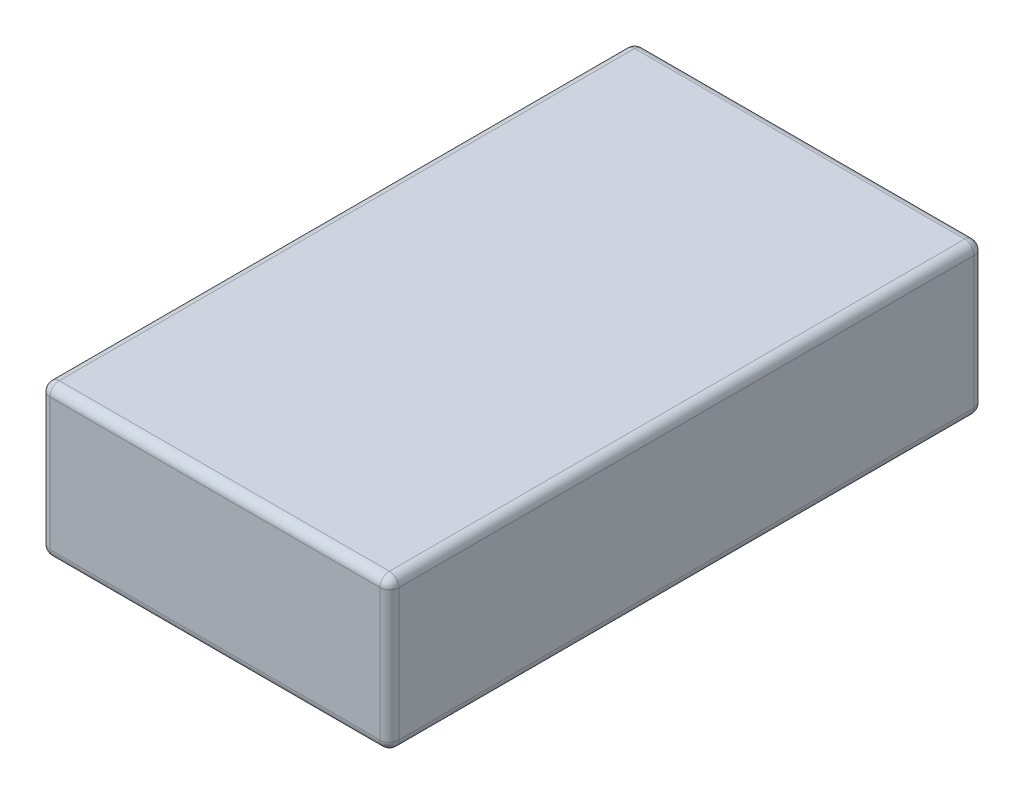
ISO-10303-21;
HEADER;
FILE_DESCRIPTION(('STEP AP214'),'2;1');
FILE_NAME('part.step','',(''),(''),'','','');
FILE_SCHEMA(('AUTOMOTIVE_DESIGN { 1 0 10303 214 1 1 1 1 }'));
ENDSEC;
DATA;
#1=APPLICATION_CONTEXT('core data for automotive mechanical design processes');
#2=APPLICATION_PROTOCOL_DEFINITION('international standard','automotive_design',2000,#1);
#3=PRODUCT_CONTEXT('',#1,'mechanical');
#4=PRODUCT('Part','Part','',(#3));
#5=PRODUCT_RELATED_PRODUCT_CATEGORY('part','',(#4));
#6=PRODUCT_DEFINITION_FORMATION('','',#4);
#7=PRODUCT_DEFINITION_CONTEXT('part definition',#1,'design');
#8=PRODUCT_DEFINITION('design','',#6,#7);
#9=PRODUCT_DEFINITION_SHAPE('','',#8);
#10=(LENGTH_UNIT() NAMED_UNIT(*) SI_UNIT(.MILLI.,.METRE.));
#11=(NAMED_UNIT(*) PLANE_ANGLE_UNIT() SI_UNIT($,.RADIAN.));
#12=(NAMED_UNIT(*) SI_UNIT($,.STERADIAN.) SOLID_ANGLE_UNIT());
#13=UNCERTAINTY_MEASURE_WITH_UNIT(LENGTH_MEASURE(1.E-05),#10,'distance_accuracy_value','');
#14=(GEOMETRIC_REPRESENTATION_CONTEXT(3) GLOBAL_UNCERTAINTY_ASSIGNED_CONTEXT((#13)) GLOBAL_UNIT_ASSIGNED_CONTEXT((#10,
#11,#12)) REPRESENTATION_CONTEXT('',''));
#15=CARTESIAN_POINT('',(0.,0.,0.));
#16=DIRECTION('',(0.,0.,1.));
#17=DIRECTION('',(1.,0.,0.));
#18=AXIS2_PLACEMENT_3D('',#15,#16,#17);
#19=CARTESIAN_POINT('',(20.,2.5,-7.));
#20=DIRECTION('',(0.,-1.,0.));
#21=DIRECTION('',(0.,0.,-1.));
#22=AXIS2_PLACEMENT_3D('',#19,#20,#21);
#23=PLANE('',#22);
#24=DIRECTION('',(0.,0.,-1.));
#25=VECTOR('',#24,1.);
#26=CARTESIAN_POINT('',(20.,2.5,-3.));
#27=LINE('',#26,#25);
#28=CARTESIAN_POINT('',(20.,2.5,-3.));
#29=VERTEX_POINT('',#28);
#30=CARTESIAN_POINT('',(20.,2.5,-7.));
#31=VERTEX_POINT('',#30);
#32=EDGE_CURVE('E224',#29,#31,#27,.T.);
#33=ORIENTED_EDGE('',*,*,#32,.T.);
#34=DIRECTION('',(1.,0.,0.));
#35=VECTOR('',#34,1.);
#36=CARTESIAN_POINT('',(20.,2.5,-7.));
#37=LINE('',#36,#35);
#38=CARTESIAN_POINT('',(28.,2.5,-7.));
#39=VERTEX_POINT('',#38);
#40=EDGE_CURVE('E227',#31,#39,#37,.T.);
#41=ORIENTED_EDGE('',*,*,#40,.T.);
#42=DIRECTION('',(0.,0.,1.));
#43=VECTOR('',#42,1.);
#44=CARTESIAN_POINT('',(28.,2.5,-3.));
#45=LINE('',#44,#43);
#46=CARTESIAN_POINT('',(28.,2.5,-3.));
#47=VERTEX_POINT('',#46);
#48=EDGE_CURVE('E230',#39,#47,#45,.T.);
#49=ORIENTED_EDGE('',*,*,#48,.T.);
#50=DIRECTION('',(-1.,0.,0.));
#51=VECTOR('',#50,1.);
#52=CARTESIAN_POINT('',(20.,2.5,-3.));
#53=LINE('',#52,#51);
#54=EDGE_CURVE('E233',#47,#29,#53,.T.);
#55=ORIENTED_EDGE('',*,*,#54,.T.);
#56=EDGE_LOOP('',(#33,#41,#49,#55));
#57=FACE_BOUND('',#56,.T.);
#58=DIRECTION('',(1.,0.,0.));
#59=VECTOR('',#58,1.);
#60=CARTESIAN_POINT('',(20.2,2.5,-6.5));
#61=LINE('',#60,#59);
#62=CARTESIAN_POINT('',(20.2,2.5,-6.5));
#63=VERTEX_POINT('',#62);
#64=CARTESIAN_POINT('',(23.2,2.5,-6.5));
#65=VERTEX_POINT('',#64);
#66=EDGE_CURVE('E175',#63,#65,#61,.T.);
#67=ORIENTED_EDGE('',*,*,#66,.F.);
#68=DIRECTION('',(0.,0.,-1.));
#69=VECTOR('',#68,1.);
#70=CARTESIAN_POINT('',(20.2,2.5,-3.5));
#71=LINE('',#70,#69);
#72=CARTESIAN_POINT('',(20.2,2.5,-3.5));
#73=VERTEX_POINT('',#72);
#74=EDGE_CURVE('E186',#73,#63,#71,.T.);
#75=ORIENTED_EDGE('',*,*,#74,.F.);
#76=DIRECTION('',(-1.,0.,0.));
#77=VECTOR('',#76,1.);
#78=CARTESIAN_POINT('',(20.2,2.5,-3.5));
#79=LINE('',#78,#77);
#80=CARTESIAN_POINT('',(23.2,2.5,-3.5));
#81=VERTEX_POINT('',#80);
#82=EDGE_CURVE('E198',#81,#73,#79,.T.);
#83=ORIENTED_EDGE('',*,*,#82,.F.);
#84=DIRECTION('',(0.,0.,1.));
#85=VECTOR('',#84,1.);
#86=CARTESIAN_POINT('',(23.2,2.5,-3.5));
#87=LINE('',#86,#85);
#88=EDGE_CURVE('E196',#65,#81,#87,.T.);
#89=ORIENTED_EDGE('',*,*,#88,.F.);
#90=EDGE_LOOP('',(#67,#75,#83,#89));
#91=FACE_BOUND('',#90,.T.);
#92=ADVANCED_FACE('F33',(#57,#91),#23,.T.);
#93=CARTESIAN_POINT('',(0.,16.,0.));
#94=DIRECTION('',(1.,0.,0.));
#95=DIRECTION('',(0.,0.,-1.));
#96=AXIS2_PLACEMENT_3D('',#93,#94,#95);
#97=PLANE('',#96);
#98=DIRECTION('',(0.,-1.,0.));
#99=VECTOR('',#98,1.);
#100=CARTESIAN_POINT('',(0.,16.,-62.));
#101=LINE('',#100,#99);
#102=CARTESIAN_POINT('',(0.,15.,-62.));
#103=VERTEX_POINT('',#102);
#104=CARTESIAN_POINT('',(0.,1.,-62.));
#105=VERTEX_POINT('',#104);
#106=EDGE_CURVE('E249',#103,#105,#101,.T.);
#107=ORIENTED_EDGE('',*,*,#106,.T.);
#108=DIRECTION('',(0.,0.,1.));
#109=VECTOR('',#108,1.);
#110=CARTESIAN_POINT('',(0.,1.,0.));
#111=LINE('',#110,#109);
#112=CARTESIAN_POINT('',(0.,1.,-1.));
#113=VERTEX_POINT('',#112);
#114=EDGE_CURVE('E251',#105,#113,#111,.T.);
#115=ORIENTED_EDGE('',*,*,#114,.T.);
#116=DIRECTION('',(0.,-1.,0.));
#117=VECTOR('',#116,1.);
#118=CARTESIAN_POINT('',(0.,16.,-1.));
#119=LINE('',#118,#117);
#120=CARTESIAN_POINT('',(0.,15.,-1.));
#121=VERTEX_POINT('',#120);
#122=EDGE_CURVE('E247',#113,#121,#119,.F.);
#123=ORIENTED_EDGE('',*,*,#122,.T.);
#124=DIRECTION('',(0.,0.,1.));
#125=VECTOR('',#124,1.);
#126=CARTESIAN_POINT('',(0.,15.,0.));
#127=LINE('',#126,#125);
#128=EDGE_CURVE('E239',#121,#103,#127,.F.);
#129=ORIENTED_EDGE('',*,*,#128,.T.);
#130=EDGE_LOOP('',(#107,#115,#123,#129));
#131=FACE_BOUND('',#130,.T.);
#132=ADVANCED_FACE('F35',(#131),#97,.F.);
#133=CARTESIAN_POINT('',(0.,16.,0.));
#134=DIRECTION('',(0.,0.,-1.));
#135=DIRECTION('',(-1.,0.,0.));
#136=AXIS2_PLACEMENT_3D('',#133,#134,#135);
#137=PLANE('',#136);
#138=DIRECTION('',(1.,0.,0.));
#139=VECTOR('',#138,1.);
#140=CARTESIAN_POINT('',(0.,15.,0.));
#141=LINE('',#140,#139);
#142=CARTESIAN_POINT('',(36.,15.,0.));
#143=VERTEX_POINT('',#142);
#144=CARTESIAN_POINT('',(1.,15.,0.));
#145=VERTEX_POINT('',#144);
#146=EDGE_CURVE('E272',#143,#145,#141,.F.);
#147=ORIENTED_EDGE('',*,*,#146,.T.);
#148=DIRECTION('',(0.,-1.,0.));
#149=VECTOR('',#148,1.);
#150=CARTESIAN_POINT('',(1.,16.,0.));
#151=LINE('',#150,#149);
#152=CARTESIAN_POINT('',(1.,1.,0.));
#153=VERTEX_POINT('',#152);
#154=EDGE_CURVE('E278',#145,#153,#151,.T.);
#155=ORIENTED_EDGE('',*,*,#154,.T.);
#156=DIRECTION('',(1.,0.,0.));
#157=VECTOR('',#156,1.);
#158=CARTESIAN_POINT('',(37.,1.,0.));
#159=LINE('',#158,#157);
#160=CARTESIAN_POINT('',(36.,1.,0.));
#161=VERTEX_POINT('',#160);
#162=EDGE_CURVE('E276',#153,#161,#159,.T.);
#163=ORIENTED_EDGE('',*,*,#162,.T.);
#164=DIRECTION('',(0.,-1.,0.));
#165=VECTOR('',#164,1.);
#166=CARTESIAN_POINT('',(36.,16.,0.));
#167=LINE('',#166,#165);
#168=EDGE_CURVE('E274',#161,#143,#167,.F.);
#169=ORIENTED_EDGE('',*,*,#168,.T.);
#170=EDGE_LOOP('',(#147,#155,#163,#169));
#171=FACE_BOUND('',#170,.T.);
#172=ADVANCED_FACE('F444',(#171),#137,.F.);
#173=CARTESIAN_POINT('',(37.,16.,0.));
#174=DIRECTION('',(-1.,0.,0.));
#175=DIRECTION('',(0.,0.,1.));
#176=AXIS2_PLACEMENT_3D('',#173,#174,#175);
#177=PLANE('',#176);
#178=DIRECTION('',(0.,0.,-1.));
#179=VECTOR('',#178,1.);
#180=CARTESIAN_POINT('',(37.,15.,0.));
#181=LINE('',#180,#179);
#182=CARTESIAN_POINT('',(37.,15.,-62.));
#183=VERTEX_POINT('',#182);
#184=CARTESIAN_POINT('',(37.,15.,-1.));
#185=VERTEX_POINT('',#184);
#186=EDGE_CURVE('E281',#183,#185,#181,.F.);
#187=ORIENTED_EDGE('',*,*,#186,.T.);
#188=DIRECTION('',(0.,-1.,0.));
#189=VECTOR('',#188,1.);
#190=CARTESIAN_POINT('',(37.,16.,-1.));
#191=LINE('',#190,#189);
#192=CARTESIAN_POINT('',(37.,1.,-1.));
#193=VERTEX_POINT('',#192);
#194=EDGE_CURVE('E287',#185,#193,#191,.T.);
#195=ORIENTED_EDGE('',*,*,#194,.T.);
#196=DIRECTION('',(0.,0.,-1.));
#197=VECTOR('',#196,1.);
#198=CARTESIAN_POINT('',(37.,1.,-63.));
#199=LINE('',#198,#197);
#200=CARTESIAN_POINT('',(37.,1.,-62.));
#201=VERTEX_POINT('',#200);
#202=EDGE_CURVE('E285',#193,#201,#199,.T.);
#203=ORIENTED_EDGE('',*,*,#202,.T.);
#204=DIRECTION('',(0.,-1.,0.));
#205=VECTOR('',#204,1.);
#206=CARTESIAN_POINT('',(37.,16.,-62.));
#207=LINE('',#206,#205);
#208=EDGE_CURVE('E283',#201,#183,#207,.F.);
#209=ORIENTED_EDGE('',*,*,#208,.T.);
#210=EDGE_LOOP('',(#187,#195,#203,#209));
#211=FACE_BOUND('',#210,.T.);
#212=ADVANCED_FACE('F472',(#211),#177,.F.);
#213=CARTESIAN_POINT('',(0.,16.,-63.));
#214=DIRECTION('',(0.,0.,1.));
#215=DIRECTION('',(1.,0.,0.));
#216=AXIS2_PLACEMENT_3D('',#213,#214,#215);
#217=PLANE('',#216);
#218=DIRECTION('',(0.,-1.,0.));
#219=VECTOR('',#218,1.);
#220=CARTESIAN_POINT('',(36.,16.,-63.));
#221=LINE('',#220,#219);
#222=CARTESIAN_POINT('',(36.,15.,-63.));
#223=VERTEX_POINT('',#222);
#224=CARTESIAN_POINT('',(36.,1.,-63.));
#225=VERTEX_POINT('',#224);
#226=EDGE_CURVE('E265',#223,#225,#221,.T.);
#227=ORIENTED_EDGE('',*,*,#226,.T.);
#228=DIRECTION('',(-1.,0.,0.));
#229=VECTOR('',#228,1.);
#230=CARTESIAN_POINT('',(0.,1.,-63.));
#231=LINE('',#230,#229);
#232=CARTESIAN_POINT('',(1.,1.,-63.));
#233=VERTEX_POINT('',#232);
#234=EDGE_CURVE('E269',#225,#233,#231,.T.);
#235=ORIENTED_EDGE('',*,*,#234,.T.);
#236=DIRECTION('',(0.,-1.,0.));
#237=VECTOR('',#236,1.);
#238=CARTESIAN_POINT('',(1.,16.,-63.));
#239=LINE('',#238,#237);
#240=CARTESIAN_POINT('',(1.,15.,-63.));
#241=VERTEX_POINT('',#240);
#242=EDGE_CURVE('E267',#233,#241,#239,.F.);
#243=ORIENTED_EDGE('',*,*,#242,.T.);
#244=DIRECTION('',(-1.,0.,0.));
#245=VECTOR('',#244,1.);
#246=CARTESIAN_POINT('',(0.,15.,-63.));
#247=LINE('',#246,#245);
#248=EDGE_CURVE('E263',#241,#223,#247,.F.);
#249=ORIENTED_EDGE('',*,*,#248,.T.);
#250=EDGE_LOOP('',(#227,#235,#243,#249));
#251=FACE_BOUND('',#250,.T.);
#252=ADVANCED_FACE('F343',(#251),#217,.F.);
#253=CARTESIAN_POINT('',(0.,16.,-63.));
#254=DIRECTION('',(0.,-1.,0.));
#255=DIRECTION('',(0.,0.,-1.));
#256=AXIS2_PLACEMENT_3D('',#253,#254,#255);
#257=PLANE('',#256);
#258=DIRECTION('',(0.,0.,-1.));
#259=VECTOR('',#258,1.);
#260=CARTESIAN_POINT('',(36.,16.,-63.));
#261=LINE('',#260,#259);
#262=CARTESIAN_POINT('',(36.,16.,-1.));
#263=VERTEX_POINT('',#262);
#264=CARTESIAN_POINT('',(36.,16.,-62.));
#265=VERTEX_POINT('',#264);
#266=EDGE_CURVE('E290',#263,#265,#261,.T.);
#267=ORIENTED_EDGE('',*,*,#266,.T.);
#268=DIRECTION('',(-1.,0.,0.));
#269=VECTOR('',#268,1.);
#270=CARTESIAN_POINT('',(0.,16.,-62.));
#271=LINE('',#270,#269);
#272=CARTESIAN_POINT('',(1.,16.,-62.));
#273=VERTEX_POINT('',#272);
#274=EDGE_CURVE('E11',#265,#273,#271,.T.);
#275=ORIENTED_EDGE('',*,*,#274,.T.);
#276=DIRECTION('',(0.,0.,1.));
#277=VECTOR('',#276,1.);
#278=CARTESIAN_POINT('',(1.,16.,-63.));
#279=LINE('',#278,#277);
#280=CARTESIAN_POINT('',(1.,16.,-1.));
#281=VERTEX_POINT('',#280);
#282=EDGE_CURVE('E41',#273,#281,#279,.T.);
#283=ORIENTED_EDGE('',*,*,#282,.T.);
#284=DIRECTION('',(1.,0.,0.));
#285=VECTOR('',#284,1.);
#286=CARTESIAN_POINT('',(0.,16.,-1.));
#287=LINE('',#286,#285);
#288=EDGE_CURVE('E292',#281,#263,#287,.T.);
#289=ORIENTED_EDGE('',*,*,#288,.T.);
#290=EDGE_LOOP('',(#267,#275,#283,#289));
#291=FACE_BOUND('',#290,.T.);
#292=ADVANCED_FACE('F294',(#291),#257,.F.);
#293=CARTESIAN_POINT('',(0.,0.,-63.));
#294=DIRECTION('',(0.,-1.,0.));
#295=DIRECTION('',(0.,0.,-1.));
#296=AXIS2_PLACEMENT_3D('',#293,#294,#295);
#297=PLANE('',#296);
#298=DIRECTION('',(1.,0.,0.));
#299=VECTOR('',#298,1.);
#300=CARTESIAN_POINT('',(0.,0.,-1.));
#301=LINE('',#300,#299);
#302=CARTESIAN_POINT('',(36.,0.,-1.));
#303=VERTEX_POINT('',#302);
#304=CARTESIAN_POINT('',(1.,0.,-1.));
#305=VERTEX_POINT('',#304);
#306=EDGE_CURVE('E256',#303,#305,#301,.F.);
#307=ORIENTED_EDGE('',*,*,#306,.T.);
#308=DIRECTION('',(0.,0.,1.));
#309=VECTOR('',#308,1.);
#310=CARTESIAN_POINT('',(1.,0.,-63.));
#311=LINE('',#310,#309);
#312=CARTESIAN_POINT('',(1.,0.,-62.));
#313=VERTEX_POINT('',#312);
#314=EDGE_CURVE('E260',#305,#313,#311,.F.);
#315=ORIENTED_EDGE('',*,*,#314,.T.);
#316=DIRECTION('',(-1.,0.,0.));
#317=VECTOR('',#316,1.);
#318=CARTESIAN_POINT('',(37.,0.,-62.));
#319=LINE('',#318,#317);
#320=CARTESIAN_POINT('',(36.,0.,-62.));
#321=VERTEX_POINT('',#320);
#322=EDGE_CURVE('E258',#313,#321,#319,.F.);
#323=ORIENTED_EDGE('',*,*,#322,.T.);
#324=DIRECTION('',(0.,0.,-1.));
#325=VECTOR('',#324,1.);
#326=CARTESIAN_POINT('',(36.,0.,0.));
#327=LINE('',#326,#325);
#328=EDGE_CURVE('E254',#321,#303,#327,.F.);
#329=ORIENTED_EDGE('',*,*,#328,.T.);
#330=EDGE_LOOP('',(#307,#315,#323,#329));
#331=FACE_BOUND('',#330,.T.);
#332=DIRECTION('',(0.,0.,-1.));
#333=VECTOR('',#332,1.);
#334=CARTESIAN_POINT('',(20.,0.,-3.));
#335=LINE('',#334,#333);
#336=CARTESIAN_POINT('',(20.,0.,-3.));
#337=VERTEX_POINT('',#336);
#338=CARTESIAN_POINT('',(20.,0.,-7.));
#339=VERTEX_POINT('',#338);
#340=EDGE_CURVE('E181',#337,#339,#335,.T.);
#341=ORIENTED_EDGE('',*,*,#340,.F.);
#342=DIRECTION('',(-1.,0.,0.));
#343=VECTOR('',#342,1.);
#344=CARTESIAN_POINT('',(20.,0.,-3.));
#345=LINE('',#344,#343);
#346=CARTESIAN_POINT('',(28.,0.,-3.));
#347=VERTEX_POINT('',#346);
#348=EDGE_CURVE('E221',#347,#337,#345,.T.);
#349=ORIENTED_EDGE('',*,*,#348,.F.);
#350=DIRECTION('',(0.,0.,1.));
#351=VECTOR('',#350,1.);
#352=CARTESIAN_POINT('',(28.,0.,-3.));
#353=LINE('',#352,#351);
#354=CARTESIAN_POINT('',(28.,0.,-7.));
#355=VERTEX_POINT('',#354);
#356=EDGE_CURVE('E218',#355,#347,#353,.T.);
#357=ORIENTED_EDGE('',*,*,#356,.F.);
#358=DIRECTION('',(1.,0.,0.));
#359=VECTOR('',#358,1.);
#360=CARTESIAN_POINT('',(20.,0.,-7.));
#361=LINE('',#360,#359);
#362=EDGE_CURVE('E215',#339,#355,#361,.T.);
#363=ORIENTED_EDGE('',*,*,#362,.F.);
#364=EDGE_LOOP('',(#341,#349,#357,#363));
#365=FACE_BOUND('',#364,.T.);
#366=ADVANCED_FACE('F463',(#331,#365),#297,.T.);
#367=CARTESIAN_POINT('',(20.,2.5,-3.));
#368=DIRECTION('',(-1.,0.,0.));
#369=DIRECTION('',(0.,0.,1.));
#370=AXIS2_PLACEMENT_3D('',#367,#368,#369);
#371=PLANE('',#370);
#372=ORIENTED_EDGE('',*,*,#340,.T.);
#373=DIRECTION('',(0.,-1.,0.));
#374=VECTOR('',#373,1.);
#375=CARTESIAN_POINT('',(20.,2.5,-7.));
#376=LINE('',#375,#374);
#377=EDGE_CURVE('E236',#31,#339,#376,.T.);
#378=ORIENTED_EDGE('',*,*,#377,.F.);
#379=ORIENTED_EDGE('',*,*,#32,.F.);
#380=DIRECTION('',(0.,-1.,0.));
#381=VECTOR('',#380,1.);
#382=CARTESIAN_POINT('',(20.,2.5,-3.));
#383=LINE('',#382,#381);
#384=EDGE_CURVE('E237',#29,#337,#383,.T.);
#385=ORIENTED_EDGE('',*,*,#384,.T.);
#386=EDGE_LOOP('',(#372,#378,#379,#385));
#387=FACE_BOUND('',#386,.T.);
#388=ADVANCED_FACE('F452',(#387),#371,.F.);
#389=CARTESIAN_POINT('',(20.,2.5,-3.));
#390=DIRECTION('',(0.,0.,1.));
#391=DIRECTION('',(1.,0.,0.));
#392=AXIS2_PLACEMENT_3D('',#389,#390,#391);
#393=PLANE('',#392);
#394=ORIENTED_EDGE('',*,*,#348,.T.);
#395=ORIENTED_EDGE('',*,*,#384,.F.);
#396=ORIENTED_EDGE('',*,*,#54,.F.);
#397=DIRECTION('',(0.,-1.,0.));
#398=VECTOR('',#397,1.);
#399=CARTESIAN_POINT('',(28.,2.5,-3.));
#400=LINE('',#399,#398);
#401=EDGE_CURVE('E240',#47,#347,#400,.T.);
#402=ORIENTED_EDGE('',*,*,#401,.T.);
#403=EDGE_LOOP('',(#394,#395,#396,#402));
#404=FACE_BOUND('',#403,.T.);
#405=ADVANCED_FACE('F448',(#404),#393,.F.);
#406=CARTESIAN_POINT('',(28.,2.5,-3.));
#407=DIRECTION('',(1.,0.,0.));
#408=DIRECTION('',(0.,0.,-1.));
#409=AXIS2_PLACEMENT_3D('',#406,#407,#408);
#410=PLANE('',#409);
#411=ORIENTED_EDGE('',*,*,#356,.T.);
#412=ORIENTED_EDGE('',*,*,#401,.F.);
#413=ORIENTED_EDGE('',*,*,#48,.F.);
#414=DIRECTION('',(0.,-1.,0.));
#415=VECTOR('',#414,1.);
#416=CARTESIAN_POINT('',(28.,2.5,-7.));
#417=LINE('',#416,#415);
#418=EDGE_CURVE('E242',#39,#355,#417,.T.);
#419=ORIENTED_EDGE('',*,*,#418,.T.);
#420=EDGE_LOOP('',(#411,#412,#413,#419));
#421=FACE_BOUND('',#420,.T.);
#422=ADVANCED_FACE('F451',(#421),#410,.F.);
#423=CARTESIAN_POINT('',(20.,2.5,-7.));
#424=DIRECTION('',(0.,0.,-1.));
#425=DIRECTION('',(-1.,0.,0.));
#426=AXIS2_PLACEMENT_3D('',#423,#424,#425);
#427=PLANE('',#426);
#428=ORIENTED_EDGE('',*,*,#362,.T.);
#429=ORIENTED_EDGE('',*,*,#418,.F.);
#430=ORIENTED_EDGE('',*,*,#40,.F.);
#431=ORIENTED_EDGE('',*,*,#377,.T.);
#432=EDGE_LOOP('',(#428,#429,#430,#431));
#433=FACE_BOUND('',#432,.T.);
#434=ADVANCED_FACE('F456',(#433),#427,.F.);
#435=CARTESIAN_POINT('',(20.2,-2.,-3.5));
#436=DIRECTION('',(1.,0.,0.));
#437=DIRECTION('',(0.,0.,-1.));
#438=AXIS2_PLACEMENT_3D('',#435,#436,#437);
#439=PLANE('',#438);
#440=ORIENTED_EDGE('',*,*,#74,.T.);
#441=DIRECTION('',(0.,1.,0.));
#442=VECTOR('',#441,1.);
#443=CARTESIAN_POINT('',(20.2,-2.,-6.5));
#444=LINE('',#443,#442);
#445=CARTESIAN_POINT('',(20.2,-2.,-6.5));
#446=VERTEX_POINT('',#445);
#447=EDGE_CURVE('E170',#446,#63,#444,.T.);
#448=ORIENTED_EDGE('',*,*,#447,.F.);
#449=DIRECTION('',(0.,0.,-1.));
#450=VECTOR('',#449,1.);
#451=CARTESIAN_POINT('',(20.2,-2.,-3.5));
#452=LINE('',#451,#450);
#453=CARTESIAN_POINT('',(20.2,-2.,-3.5));
#454=VERTEX_POINT('',#453);
#455=EDGE_CURVE('E203',#454,#446,#452,.T.);
#456=ORIENTED_EDGE('',*,*,#455,.F.);
#457=DIRECTION('',(0.,1.,0.));
#458=VECTOR('',#457,1.);
#459=CARTESIAN_POINT('',(20.2,-2.,-3.5));
#460=LINE('',#459,#458);
#461=EDGE_CURVE('E189',#454,#73,#460,.T.);
#462=ORIENTED_EDGE('',*,*,#461,.T.);
#463=EDGE_LOOP('',(#440,#448,#456,#462));
#464=FACE_BOUND('',#463,.T.);
#465=ADVANCED_FACE('F187',(#464),#439,.F.);
#466=CARTESIAN_POINT('',(20.2,-2.,-6.5));
#467=DIRECTION('',(0.,0.,1.));
#468=DIRECTION('',(1.,0.,0.));
#469=AXIS2_PLACEMENT_3D('',#466,#467,#468);
#470=PLANE('',#469);
#471=ORIENTED_EDGE('',*,*,#66,.T.);
#472=DIRECTION('',(0.,1.,0.));
#473=VECTOR('',#472,1.);
#474=CARTESIAN_POINT('',(23.2,-2.,-6.5));
#475=LINE('',#474,#473);
#476=CARTESIAN_POINT('',(23.2,-2.,-6.5));
#477=VERTEX_POINT('',#476);
#478=EDGE_CURVE('E182',#477,#65,#475,.T.);
#479=ORIENTED_EDGE('',*,*,#478,.F.);
#480=DIRECTION('',(1.,0.,0.));
#481=VECTOR('',#480,1.);
#482=CARTESIAN_POINT('',(20.2,-2.,-6.5));
#483=LINE('',#482,#481);
#484=EDGE_CURVE('E177',#446,#477,#483,.T.);
#485=ORIENTED_EDGE('',*,*,#484,.F.);
#486=ORIENTED_EDGE('',*,*,#447,.T.);
#487=EDGE_LOOP('',(#471,#479,#485,#486));
#488=FACE_BOUND('',#487,.T.);
#489=ADVANCED_FACE('F172',(#488),#470,.F.);
#490=CARTESIAN_POINT('',(23.2,-2.,-3.5));
#491=DIRECTION('',(-1.,0.,0.));
#492=DIRECTION('',(0.,0.,1.));
#493=AXIS2_PLACEMENT_3D('',#490,#491,#492);
#494=PLANE('',#493);
#495=ORIENTED_EDGE('',*,*,#88,.T.);
#496=DIRECTION('',(0.,1.,0.));
#497=VECTOR('',#496,1.);
#498=CARTESIAN_POINT('',(23.2,-2.,-3.5));
#499=LINE('',#498,#497);
#500=CARTESIAN_POINT('',(23.2,-2.,-3.5));
#501=VERTEX_POINT('',#500);
#502=EDGE_CURVE('E211',#501,#81,#499,.T.);
#503=ORIENTED_EDGE('',*,*,#502,.F.);
#504=DIRECTION('',(0.,0.,1.));
#505=VECTOR('',#504,1.);
#506=CARTESIAN_POINT('',(23.2,-2.,-3.5));
#507=LINE('',#506,#505);
#508=EDGE_CURVE('E206',#477,#501,#507,.T.);
#509=ORIENTED_EDGE('',*,*,#508,.F.);
#510=ORIENTED_EDGE('',*,*,#478,.T.);
#511=EDGE_LOOP('',(#495,#503,#509,#510));
#512=FACE_BOUND('',#511,.T.);
#513=ADVANCED_FACE('F538',(#512),#494,.F.);
#514=CARTESIAN_POINT('',(20.2,-2.,-3.5));
#515=DIRECTION('',(0.,0.,-1.));
#516=DIRECTION('',(-1.,0.,0.));
#517=AXIS2_PLACEMENT_3D('',#514,#515,#516);
#518=PLANE('',#517);
#519=ORIENTED_EDGE('',*,*,#82,.T.);
#520=ORIENTED_EDGE('',*,*,#461,.F.);
#521=DIRECTION('',(-1.,0.,0.));
#522=VECTOR('',#521,1.);
#523=CARTESIAN_POINT('',(20.2,-2.,-3.5));
#524=LINE('',#523,#522);
#525=EDGE_CURVE('E208',#501,#454,#524,.T.);
#526=ORIENTED_EDGE('',*,*,#525,.F.);
#527=ORIENTED_EDGE('',*,*,#502,.T.);
#528=EDGE_LOOP('',(#519,#520,#526,#527));
#529=FACE_BOUND('',#528,.T.);
#530=ADVANCED_FACE('F534',(#529),#518,.F.);
#531=CARTESIAN_POINT('',(20.2,-2.,-6.5));
#532=DIRECTION('',(0.,-1.,0.));
#533=DIRECTION('',(0.,0.,-1.));
#534=AXIS2_PLACEMENT_3D('',#531,#532,#533);
#535=PLANE('',#534);
#536=ORIENTED_EDGE('',*,*,#455,.T.);
#537=ORIENTED_EDGE('',*,*,#484,.T.);
#538=ORIENTED_EDGE('',*,*,#508,.T.);
#539=ORIENTED_EDGE('',*,*,#525,.T.);
#540=EDGE_LOOP('',(#536,#537,#538,#539));
#541=FACE_BOUND('',#540,.T.);
#542=ADVANCED_FACE('F531',(#541),#535,.T.);
#543=CARTESIAN_POINT('',(36.,15.,-63.));
#544=DIRECTION('',(0.,0.,-1.));
#545=DIRECTION('',(-1.,0.,0.));
#546=AXIS2_PLACEMENT_3D('',#543,#544,#545);
#547=CYLINDRICAL_SURFACE('',#546,1.);
#548=CARTESIAN_POINT('',(36.,15.,-62.));
#549=DIRECTION('',(0.,0.,-1.));
#550=DIRECTION('',(-1.,0.,0.));
#551=AXIS2_PLACEMENT_3D('',#548,#549,#550);
#552=CIRCLE('',#551,1.);
#553=EDGE_CURVE('E192',#265,#183,#552,.T.);
#554=ORIENTED_EDGE('',*,*,#553,.F.);
#555=ORIENTED_EDGE('',*,*,#266,.F.);
#556=CARTESIAN_POINT('',(36.,15.,-1.));
#557=DIRECTION('',(0.,0.,1.));
#558=DIRECTION('',(0.,-1.,0.));
#559=AXIS2_PLACEMENT_3D('',#556,#557,#558);
#560=CIRCLE('',#559,1.);
#561=EDGE_CURVE('E305',#185,#263,#560,.T.);
#562=ORIENTED_EDGE('',*,*,#561,.F.);
#563=ORIENTED_EDGE('',*,*,#186,.F.);
#564=EDGE_LOOP('',(#554,#555,#562,#563));
#565=FACE_BOUND('',#564,.T.);
#566=ADVANCED_FACE('F303',(#565),#547,.T.);
#567=CARTESIAN_POINT('',(36.,15.,-62.));
#568=DIRECTION('',(0.,0.,1.));
#569=DIRECTION('',(1.,0.,0.));
#570=AXIS2_PLACEMENT_3D('',#567,#568,#569);
#571=SPHERICAL_SURFACE('',#570,1.);
#572=CARTESIAN_POINT('',(36.,15.,-62.));
#573=DIRECTION('',(1.,0.,0.));
#574=DIRECTION('',(0.,0.,-1.));
#575=AXIS2_PLACEMENT_3D('',#572,#573,#574);
#576=CIRCLE('',#575,1.);
#577=EDGE_CURVE('E320',#265,#223,#576,.F.);
#578=ORIENTED_EDGE('',*,*,#577,.F.);
#579=ORIENTED_EDGE('',*,*,#553,.T.);
#580=CARTESIAN_POINT('',(36.,15.,-62.));
#581=DIRECTION('',(0.,1.,0.));
#582=DIRECTION('',(0.,0.,1.));
#583=AXIS2_PLACEMENT_3D('',#580,#581,#582);
#584=CIRCLE('',#583,1.);
#585=EDGE_CURVE('E317',#223,#183,#584,.F.);
#586=ORIENTED_EDGE('',*,*,#585,.F.);
#587=EDGE_LOOP('',(#578,#579,#586));
#588=FACE_BOUND('',#587,.T.);
#589=ADVANCED_FACE('F331',(#588),#571,.T.);
#590=CARTESIAN_POINT('',(36.,15.,-1.));
#591=DIRECTION('',(0.,0.,1.));
#592=DIRECTION('',(1.,0.,0.));
#593=AXIS2_PLACEMENT_3D('',#590,#591,#592);
#594=SPHERICAL_SURFACE('',#593,1.);
#595=CARTESIAN_POINT('',(36.,15.,-1.));
#596=DIRECTION('',(0.,1.,0.));
#597=DIRECTION('',(0.,0.,1.));
#598=AXIS2_PLACEMENT_3D('',#595,#596,#597);
#599=CIRCLE('',#598,1.);
#600=EDGE_CURVE('E315',#185,#143,#599,.F.);
#601=ORIENTED_EDGE('',*,*,#600,.F.);
#602=ORIENTED_EDGE('',*,*,#561,.T.);
#603=CARTESIAN_POINT('',(36.,15.,-1.));
#604=DIRECTION('',(1.,0.,0.));
#605=DIRECTION('',(0.,0.,-1.));
#606=AXIS2_PLACEMENT_3D('',#603,#604,#605);
#607=CIRCLE('',#606,1.);
#608=EDGE_CURVE('E312',#143,#263,#607,.F.);
#609=ORIENTED_EDGE('',*,*,#608,.F.);
#610=EDGE_LOOP('',(#601,#602,#609));
#611=FACE_BOUND('',#610,.T.);
#612=ADVANCED_FACE('F311',(#611),#594,.T.);
#613=CARTESIAN_POINT('',(36.,16.,-62.));
#614=DIRECTION('',(0.,-1.,0.));
#615=DIRECTION('',(0.,0.,-1.));
#616=AXIS2_PLACEMENT_3D('',#613,#614,#615);
#617=CYLINDRICAL_SURFACE('',#616,1.);
#618=ORIENTED_EDGE('',*,*,#585,.T.);
#619=ORIENTED_EDGE('',*,*,#208,.F.);
#620=CARTESIAN_POINT('',(36.,1.,-62.));
#621=DIRECTION('',(0.,-1.,0.));
#622=DIRECTION('',(0.,0.,-1.));
#623=AXIS2_PLACEMENT_3D('',#620,#621,#622);
#624=CIRCLE('',#623,1.);
#625=EDGE_CURVE('E340',#225,#201,#624,.T.);
#626=ORIENTED_EDGE('',*,*,#625,.F.);
#627=ORIENTED_EDGE('',*,*,#226,.F.);
#628=EDGE_LOOP('',(#618,#619,#626,#627));
#629=FACE_BOUND('',#628,.T.);
#630=ADVANCED_FACE('F336',(#629),#617,.T.);
#631=CARTESIAN_POINT('',(0.,15.,-62.));
#632=DIRECTION('',(-1.,0.,0.));
#633=DIRECTION('',(0.,0.,1.));
#634=AXIS2_PLACEMENT_3D('',#631,#632,#633);
#635=CYLINDRICAL_SURFACE('',#634,1.);
#636=ORIENTED_EDGE('',*,*,#577,.T.);
#637=ORIENTED_EDGE('',*,*,#248,.F.);
#638=CARTESIAN_POINT('',(1.,15.,-62.));
#639=DIRECTION('',(-1.,0.,0.));
#640=DIRECTION('',(0.,0.,1.));
#641=AXIS2_PLACEMENT_3D('',#638,#639,#640);
#642=CIRCLE('',#641,1.);
#643=EDGE_CURVE('E349',#273,#241,#642,.T.);
#644=ORIENTED_EDGE('',*,*,#643,.F.);
#645=ORIENTED_EDGE('',*,*,#274,.F.);
#646=EDGE_LOOP('',(#636,#637,#644,#645));
#647=FACE_BOUND('',#646,.T.);
#648=ADVANCED_FACE('F348',(#647),#635,.T.);
#649=CARTESIAN_POINT('',(1.,15.,-63.));
#650=DIRECTION('',(0.,0.,1.));
#651=DIRECTION('',(1.,0.,0.));
#652=AXIS2_PLACEMENT_3D('',#649,#650,#651);
#653=CYLINDRICAL_SURFACE('',#652,1.);
#654=CARTESIAN_POINT('',(1.,15.,-1.));
#655=DIRECTION('',(0.,0.,1.));
#656=DIRECTION('',(1.,0.,0.));
#657=AXIS2_PLACEMENT_3D('',#654,#655,#656);
#658=CIRCLE('',#657,1.);
#659=EDGE_CURVE('E356',#281,#121,#658,.T.);
#660=ORIENTED_EDGE('',*,*,#659,.F.);
#661=ORIENTED_EDGE('',*,*,#282,.F.);
#662=CARTESIAN_POINT('',(1.,15.,-62.));
#663=DIRECTION('',(0.,0.,-1.));
#664=DIRECTION('',(-1.,0.,0.));
#665=AXIS2_PLACEMENT_3D('',#662,#663,#664);
#666=CIRCLE('',#665,1.);
#667=EDGE_CURVE('E48',#103,#273,#666,.T.);
#668=ORIENTED_EDGE('',*,*,#667,.F.);
#669=ORIENTED_EDGE('',*,*,#128,.F.);
#670=EDGE_LOOP('',(#660,#661,#668,#669));
#671=FACE_BOUND('',#670,.T.);
#672=ADVANCED_FACE('F353',(#671),#653,.T.);
#673=CARTESIAN_POINT('',(0.,15.,-1.));
#674=DIRECTION('',(1.,0.,0.));
#675=DIRECTION('',(0.,0.,-1.));
#676=AXIS2_PLACEMENT_3D('',#673,#674,#675);
#677=CYLINDRICAL_SURFACE('',#676,1.);
#678=ORIENTED_EDGE('',*,*,#608,.T.);
#679=ORIENTED_EDGE('',*,*,#288,.F.);
#680=CARTESIAN_POINT('',(1.,15.,-1.));
#681=DIRECTION('',(-1.,0.,0.));
#682=DIRECTION('',(0.,0.,1.));
#683=AXIS2_PLACEMENT_3D('',#680,#681,#682);
#684=CIRCLE('',#683,1.);
#685=EDGE_CURVE('E361',#145,#281,#684,.T.);
#686=ORIENTED_EDGE('',*,*,#685,.F.);
#687=ORIENTED_EDGE('',*,*,#146,.F.);
#688=EDGE_LOOP('',(#678,#679,#686,#687));
#689=FACE_BOUND('',#688,.T.);
#690=ADVANCED_FACE('F319',(#689),#677,.T.);
#691=CARTESIAN_POINT('',(36.,16.,-1.));
#692=DIRECTION('',(0.,-1.,0.));
#693=DIRECTION('',(0.,0.,-1.));
#694=AXIS2_PLACEMENT_3D('',#691,#692,#693);
#695=CYLINDRICAL_SURFACE('',#694,1.);
#696=ORIENTED_EDGE('',*,*,#600,.T.);
#697=ORIENTED_EDGE('',*,*,#168,.F.);
#698=CARTESIAN_POINT('',(36.,1.,-1.));
#699=DIRECTION('',(0.,-1.,0.));
#700=DIRECTION('',(0.,0.,-1.));
#701=AXIS2_PLACEMENT_3D('',#698,#699,#700);
#702=CIRCLE('',#701,1.);
#703=EDGE_CURVE('E366',#193,#161,#702,.T.);
#704=ORIENTED_EDGE('',*,*,#703,.F.);
#705=ORIENTED_EDGE('',*,*,#194,.F.);
#706=EDGE_LOOP('',(#696,#697,#704,#705));
#707=FACE_BOUND('',#706,.T.);
#708=ADVANCED_FACE('F482',(#707),#695,.T.);
#709=CARTESIAN_POINT('',(36.,1.,0.));
#710=DIRECTION('',(0.,0.,1.));
#711=DIRECTION('',(1.,0.,0.));
#712=AXIS2_PLACEMENT_3D('',#709,#710,#711);
#713=CYLINDRICAL_SURFACE('',#712,1.);
#714=CARTESIAN_POINT('',(36.,1.,-62.));
#715=DIRECTION('',(0.,0.,-1.));
#716=DIRECTION('',(-1.,0.,0.));
#717=AXIS2_PLACEMENT_3D('',#714,#715,#716);
#718=CIRCLE('',#717,1.);
#719=EDGE_CURVE('E324',#201,#321,#718,.T.);
#720=ORIENTED_EDGE('',*,*,#719,.F.);
#721=ORIENTED_EDGE('',*,*,#202,.F.);
#722=CARTESIAN_POINT('',(36.,1.,-1.));
#723=DIRECTION('',(0.,0.,1.));
#724=DIRECTION('',(1.,0.,0.));
#725=AXIS2_PLACEMENT_3D('',#722,#723,#724);
#726=CIRCLE('',#725,1.);
#727=EDGE_CURVE('E369',#303,#193,#726,.T.);
#728=ORIENTED_EDGE('',*,*,#727,.F.);
#729=ORIENTED_EDGE('',*,*,#328,.F.);
#730=EDGE_LOOP('',(#720,#721,#728,#729));
#731=FACE_BOUND('',#730,.T.);
#732=ADVANCED_FACE('F484',(#731),#713,.T.);
#733=CARTESIAN_POINT('',(36.,1.,-62.));
#734=DIRECTION('',(0.,0.,1.));
#735=DIRECTION('',(1.,0.,0.));
#736=AXIS2_PLACEMENT_3D('',#733,#734,#735);
#737=SPHERICAL_SURFACE('',#736,1.);
#738=ORIENTED_EDGE('',*,*,#625,.T.);
#739=ORIENTED_EDGE('',*,*,#719,.T.);
#740=CARTESIAN_POINT('',(36.,1.,-62.));
#741=DIRECTION('',(1.,0.,0.));
#742=DIRECTION('',(0.,0.,-1.));
#743=AXIS2_PLACEMENT_3D('',#740,#741,#742);
#744=CIRCLE('',#743,1.);
#745=EDGE_CURVE('E378',#225,#321,#744,.F.);
#746=ORIENTED_EDGE('',*,*,#745,.F.);
#747=EDGE_LOOP('',(#738,#739,#746));
#748=FACE_BOUND('',#747,.T.);
#749=ADVANCED_FACE('F377',(#748),#737,.T.);
#750=CARTESIAN_POINT('',(1.,15.,-62.));
#751=DIRECTION('',(0.,0.,1.));
#752=DIRECTION('',(1.,0.,0.));
#753=AXIS2_PLACEMENT_3D('',#750,#751,#752);
#754=SPHERICAL_SURFACE('',#753,1.);
#755=ORIENTED_EDGE('',*,*,#667,.T.);
#756=ORIENTED_EDGE('',*,*,#643,.T.);
#757=CARTESIAN_POINT('',(1.,15.,-62.));
#758=DIRECTION('',(0.,1.,0.));
#759=DIRECTION('',(0.,0.,1.));
#760=AXIS2_PLACEMENT_3D('',#757,#758,#759);
#761=CIRCLE('',#760,1.);
#762=EDGE_CURVE('E386',#103,#241,#761,.F.);
#763=ORIENTED_EDGE('',*,*,#762,.F.);
#764=EDGE_LOOP('',(#755,#756,#763));
#765=FACE_BOUND('',#764,.T.);
#766=ADVANCED_FACE('F505',(#765),#754,.T.);
#767=CARTESIAN_POINT('',(1.,15.,-1.));
#768=DIRECTION('',(0.,0.,1.));
#769=DIRECTION('',(1.,0.,0.));
#770=AXIS2_PLACEMENT_3D('',#767,#768,#769);
#771=SPHERICAL_SURFACE('',#770,1.);
#772=ORIENTED_EDGE('',*,*,#685,.T.);
#773=ORIENTED_EDGE('',*,*,#659,.T.);
#774=CARTESIAN_POINT('',(1.,15.,-1.));
#775=DIRECTION('',(0.,1.,0.));
#776=DIRECTION('',(0.,0.,1.));
#777=AXIS2_PLACEMENT_3D('',#774,#775,#776);
#778=CIRCLE('',#777,1.);
#779=EDGE_CURVE('E364',#145,#121,#778,.F.);
#780=ORIENTED_EDGE('',*,*,#779,.F.);
#781=EDGE_LOOP('',(#772,#773,#780));
#782=FACE_BOUND('',#781,.T.);
#783=ADVANCED_FACE('F363',(#782),#771,.T.);
#784=CARTESIAN_POINT('',(36.,1.,-1.));
#785=DIRECTION('',(0.,0.,1.));
#786=DIRECTION('',(1.,0.,0.));
#787=AXIS2_PLACEMENT_3D('',#784,#785,#786);
#788=SPHERICAL_SURFACE('',#787,1.);
#789=ORIENTED_EDGE('',*,*,#727,.T.);
#790=ORIENTED_EDGE('',*,*,#703,.T.);
#791=CARTESIAN_POINT('',(36.,1.,-1.));
#792=DIRECTION('',(1.,0.,0.));
#793=DIRECTION('',(0.,0.,-1.));
#794=AXIS2_PLACEMENT_3D('',#791,#792,#793);
#795=CIRCLE('',#794,1.);
#796=EDGE_CURVE('E391',#303,#161,#795,.F.);
#797=ORIENTED_EDGE('',*,*,#796,.F.);
#798=EDGE_LOOP('',(#789,#790,#797));
#799=FACE_BOUND('',#798,.T.);
#800=ADVANCED_FACE('F488',(#799),#788,.T.);
#801=CARTESIAN_POINT('',(0.,1.,-62.));
#802=DIRECTION('',(1.,0.,0.));
#803=DIRECTION('',(0.,0.,-1.));
#804=AXIS2_PLACEMENT_3D('',#801,#802,#803);
#805=CYLINDRICAL_SURFACE('',#804,1.);
#806=ORIENTED_EDGE('',*,*,#745,.T.);
#807=ORIENTED_EDGE('',*,*,#322,.F.);
#808=CARTESIAN_POINT('',(1.,1.,-62.));
#809=DIRECTION('',(-1.,0.,0.));
#810=DIRECTION('',(0.,0.,1.));
#811=AXIS2_PLACEMENT_3D('',#808,#809,#810);
#812=CIRCLE('',#811,1.);
#813=EDGE_CURVE('E394',#233,#313,#812,.T.);
#814=ORIENTED_EDGE('',*,*,#813,.F.);
#815=ORIENTED_EDGE('',*,*,#234,.F.);
#816=EDGE_LOOP('',(#806,#807,#814,#815));
#817=FACE_BOUND('',#816,.T.);
#818=ADVANCED_FACE('F384',(#817),#805,.T.);
#819=CARTESIAN_POINT('',(1.,16.,-62.));
#820=DIRECTION('',(0.,-1.,0.));
#821=DIRECTION('',(0.,0.,-1.));
#822=AXIS2_PLACEMENT_3D('',#819,#820,#821);
#823=CYLINDRICAL_SURFACE('',#822,1.);
#824=ORIENTED_EDGE('',*,*,#762,.T.);
#825=ORIENTED_EDGE('',*,*,#242,.F.);
#826=CARTESIAN_POINT('',(1.,1.,-62.));
#827=DIRECTION('',(0.,-1.,0.));
#828=DIRECTION('',(0.,0.,-1.));
#829=AXIS2_PLACEMENT_3D('',#826,#827,#828);
#830=CIRCLE('',#829,1.);
#831=EDGE_CURVE('E397',#105,#233,#830,.T.);
#832=ORIENTED_EDGE('',*,*,#831,.F.);
#833=ORIENTED_EDGE('',*,*,#106,.F.);
#834=EDGE_LOOP('',(#824,#825,#832,#833));
#835=FACE_BOUND('',#834,.T.);
#836=ADVANCED_FACE('F425',(#835),#823,.T.);
#837=CARTESIAN_POINT('',(1.,16.,-1.));
#838=DIRECTION('',(0.,-1.,0.));
#839=DIRECTION('',(0.,0.,-1.));
#840=AXIS2_PLACEMENT_3D('',#837,#838,#839);
#841=CYLINDRICAL_SURFACE('',#840,1.);
#842=ORIENTED_EDGE('',*,*,#779,.T.);
#843=ORIENTED_EDGE('',*,*,#122,.F.);
#844=CARTESIAN_POINT('',(1.,1.,-1.));
#845=DIRECTION('',(0.,-1.,0.));
#846=DIRECTION('',(0.,0.,-1.));
#847=AXIS2_PLACEMENT_3D('',#844,#845,#846);
#848=CIRCLE('',#847,1.);
#849=EDGE_CURVE('E399',#153,#113,#848,.T.);
#850=ORIENTED_EDGE('',*,*,#849,.F.);
#851=ORIENTED_EDGE('',*,*,#154,.F.);
#852=EDGE_LOOP('',(#842,#843,#850,#851));
#853=FACE_BOUND('',#852,.T.);
#854=ADVANCED_FACE('F419',(#853),#841,.T.);
#855=CARTESIAN_POINT('',(0.,1.,-1.));
#856=DIRECTION('',(-1.,0.,0.));
#857=DIRECTION('',(0.,0.,1.));
#858=AXIS2_PLACEMENT_3D('',#855,#856,#857);
#859=CYLINDRICAL_SURFACE('',#858,1.);
#860=ORIENTED_EDGE('',*,*,#796,.T.);
#861=ORIENTED_EDGE('',*,*,#162,.F.);
#862=CARTESIAN_POINT('',(1.,1.,-1.));
#863=DIRECTION('',(-1.,0.,0.));
#864=DIRECTION('',(0.,0.,1.));
#865=AXIS2_PLACEMENT_3D('',#862,#863,#864);
#866=CIRCLE('',#865,1.);
#867=EDGE_CURVE('E402',#305,#153,#866,.T.);
#868=ORIENTED_EDGE('',*,*,#867,.F.);
#869=ORIENTED_EDGE('',*,*,#306,.F.);
#870=EDGE_LOOP('',(#860,#861,#868,#869));
#871=FACE_BOUND('',#870,.T.);
#872=ADVANCED_FACE('F429',(#871),#859,.T.);
#873=CARTESIAN_POINT('',(1.,1.,-62.));
#874=DIRECTION('',(0.,0.,1.));
#875=DIRECTION('',(1.,0.,0.));
#876=AXIS2_PLACEMENT_3D('',#873,#874,#875);
#877=SPHERICAL_SURFACE('',#876,1.);
#878=ORIENTED_EDGE('',*,*,#831,.T.);
#879=ORIENTED_EDGE('',*,*,#813,.T.);
#880=CARTESIAN_POINT('',(1.,1.,-62.));
#881=DIRECTION('',(0.,0.,-1.));
#882=DIRECTION('',(-1.,0.,0.));
#883=AXIS2_PLACEMENT_3D('',#880,#881,#882);
#884=CIRCLE('',#883,1.);
#885=EDGE_CURVE('E404',#105,#313,#884,.F.);
#886=ORIENTED_EDGE('',*,*,#885,.F.);
#887=EDGE_LOOP('',(#878,#879,#886));
#888=FACE_BOUND('',#887,.T.);
#889=ADVANCED_FACE('F427',(#888),#877,.T.);
#890=CARTESIAN_POINT('',(1.,1.,-1.));
#891=DIRECTION('',(0.,0.,1.));
#892=DIRECTION('',(1.,0.,0.));
#893=AXIS2_PLACEMENT_3D('',#890,#891,#892);
#894=SPHERICAL_SURFACE('',#893,1.);
#895=ORIENTED_EDGE('',*,*,#867,.T.);
#896=ORIENTED_EDGE('',*,*,#849,.T.);
#897=CARTESIAN_POINT('',(1.,1.,-1.));
#898=DIRECTION('',(0.,0.,1.));
#899=DIRECTION('',(1.,0.,0.));
#900=AXIS2_PLACEMENT_3D('',#897,#898,#899);
#901=CIRCLE('',#900,1.);
#902=EDGE_CURVE('E406',#305,#113,#901,.F.);
#903=ORIENTED_EDGE('',*,*,#902,.F.);
#904=EDGE_LOOP('',(#895,#896,#903));
#905=FACE_BOUND('',#904,.T.);
#906=ADVANCED_FACE('F415',(#905),#894,.T.);
#907=CARTESIAN_POINT('',(1.,1.,0.));
#908=DIRECTION('',(0.,0.,-1.));
#909=DIRECTION('',(-1.,0.,0.));
#910=AXIS2_PLACEMENT_3D('',#907,#908,#909);
#911=CYLINDRICAL_SURFACE('',#910,1.);
#912=ORIENTED_EDGE('',*,*,#885,.T.);
#913=ORIENTED_EDGE('',*,*,#314,.F.);
#914=ORIENTED_EDGE('',*,*,#902,.T.);
#915=ORIENTED_EDGE('',*,*,#114,.F.);
#916=EDGE_LOOP('',(#912,#913,#914,#915));
#917=FACE_BOUND('',#916,.T.);
#918=ADVANCED_FACE('F411',(#917),#911,.T.);
#919=CLOSED_SHELL('',(#92,#132,#172,#212,#252,#292,#366,#388,#405,#422,#434,#465,#489,#513,#530,
#542,#566,#589,#612,#630,#648,#672,#690,#708,#732,#749,#766,#783,#800,#818,#836,#854,#872,#889,
#906,#918));
#920=MANIFOLD_SOLID_BREP('B2',#919);
#921=ADVANCED_BREP_SHAPE_REPRESENTATION('',(#18,#920),#14);
#922=SHAPE_DEFINITION_REPRESENTATION(#9,#921);
ENDSEC;
END-ISO-10303-21;
